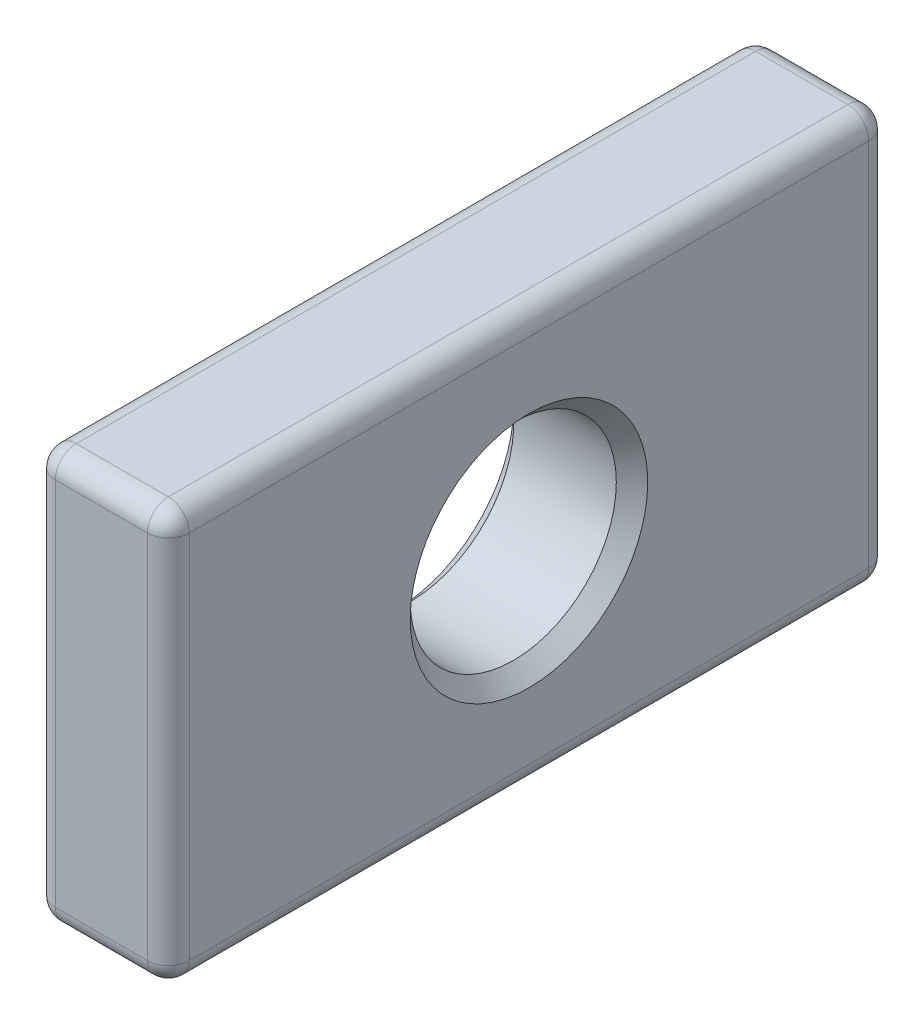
ISO-10303-21;
HEADER;
FILE_DESCRIPTION(('STEP AP214'),'2;1');
FILE_NAME('part.step','',(''),(''),'','','');
FILE_SCHEMA(('AUTOMOTIVE_DESIGN { 1 0 10303 214 1 1 1 1 }'));
ENDSEC;
DATA;
#1=APPLICATION_CONTEXT('core data for automotive mechanical design processes');
#2=APPLICATION_PROTOCOL_DEFINITION('international standard','automotive_design',2000,#1);
#3=PRODUCT_CONTEXT('',#1,'mechanical');
#4=PRODUCT('Part','Part','',(#3));
#5=PRODUCT_RELATED_PRODUCT_CATEGORY('part','',(#4));
#6=PRODUCT_DEFINITION_FORMATION('','',#4);
#7=PRODUCT_DEFINITION_CONTEXT('part definition',#1,'design');
#8=PRODUCT_DEFINITION('design','',#6,#7);
#9=PRODUCT_DEFINITION_SHAPE('','',#8);
#10=(LENGTH_UNIT() NAMED_UNIT(*) SI_UNIT(.MILLI.,.METRE.));
#11=(NAMED_UNIT(*) PLANE_ANGLE_UNIT() SI_UNIT($,.RADIAN.));
#12=(NAMED_UNIT(*) SI_UNIT($,.STERADIAN.) SOLID_ANGLE_UNIT());
#13=UNCERTAINTY_MEASURE_WITH_UNIT(LENGTH_MEASURE(1.E-05),#10,'distance_accuracy_value','');
#14=(GEOMETRIC_REPRESENTATION_CONTEXT(3) GLOBAL_UNCERTAINTY_ASSIGNED_CONTEXT((#13)) GLOBAL_UNIT_ASSIGNED_CONTEXT((#10,
#11,#12)) REPRESENTATION_CONTEXT('',''));
#15=CARTESIAN_POINT('',(0.,0.,0.));
#16=DIRECTION('',(0.,0.,1.));
#17=DIRECTION('',(1.,0.,0.));
#18=AXIS2_PLACEMENT_3D('',#15,#16,#17);
#19=CARTESIAN_POINT('',(3.25,0.,0.));
#20=DIRECTION('',(1.,0.,0.));
#21=DIRECTION('',(0.,0.,-1.));
#22=AXIS2_PLACEMENT_3D('',#19,#20,#21);
#23=PLANE('',#22);
#24=CARTESIAN_POINT('',(3.25,0.,0.));
#25=DIRECTION('',(1.,0.,0.));
#26=DIRECTION('',(0.,0.,-1.));
#27=AXIS2_PLACEMENT_3D('',#24,#25,#26);
#28=CIRCLE('',#27,5.76200000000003);
#29=CARTESIAN_POINT('',(3.25,0.,-5.76200000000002));
#30=VERTEX_POINT('',#29);
#31=EDGE_CURVE('E11',#30,#30,#28,.F.);
#32=ORIENTED_EDGE('',*,*,#31,.T.);
#33=EDGE_LOOP('',(#32));
#34=FACE_BOUND('',#33,.T.);
#35=DIRECTION('',(0.,0.,-1.));
#36=VECTOR('',#35,1.);
#37=CARTESIAN_POINT('',(3.25,-8.984,-17.5));
#38=LINE('',#37,#36);
#39=CARTESIAN_POINT('',(3.25,-8.984,16.484));
#40=VERTEX_POINT('',#39);
#41=CARTESIAN_POINT('',(3.25,-8.984,-16.484));
#42=VERTEX_POINT('',#41);
#43=EDGE_CURVE('E130',#40,#42,#38,.T.);
#44=ORIENTED_EDGE('',*,*,#43,.T.);
#45=DIRECTION('',(0.,1.,0.));
#46=VECTOR('',#45,1.);
#47=CARTESIAN_POINT('',(3.25,10.,-16.484));
#48=LINE('',#47,#46);
#49=CARTESIAN_POINT('',(3.25,8.984,-16.484));
#50=VERTEX_POINT('',#49);
#51=EDGE_CURVE('E126',#42,#50,#48,.T.);
#52=ORIENTED_EDGE('',*,*,#51,.T.);
#53=DIRECTION('',(0.,0.,1.));
#54=VECTOR('',#53,1.);
#55=CARTESIAN_POINT('',(3.25,8.984,17.5));
#56=LINE('',#55,#54);
#57=CARTESIAN_POINT('',(3.25,8.984,16.484));
#58=VERTEX_POINT('',#57);
#59=EDGE_CURVE('E119',#50,#58,#56,.T.);
#60=ORIENTED_EDGE('',*,*,#59,.T.);
#61=DIRECTION('',(0.,-1.,0.));
#62=VECTOR('',#61,1.);
#63=CARTESIAN_POINT('',(3.25,-10.,16.484));
#64=LINE('',#63,#62);
#65=EDGE_CURVE('E123',#58,#40,#64,.T.);
#66=ORIENTED_EDGE('',*,*,#65,.T.);
#67=EDGE_LOOP('',(#44,#52,#60,#66));
#68=FACE_BOUND('',#67,.T.);
#69=ADVANCED_FACE('F32',(#34,#68),#23,.T.);
#70=CARTESIAN_POINT('',(-3.25,0.,0.));
#71=DIRECTION('',(1.,0.,0.));
#72=DIRECTION('',(0.,0.,-1.));
#73=AXIS2_PLACEMENT_3D('',#70,#71,#72);
#74=PLANE('',#73);
#75=CARTESIAN_POINT('',(-3.25,0.,0.));
#76=DIRECTION('',(1.,0.,0.));
#77=DIRECTION('',(0.,0.,-1.));
#78=AXIS2_PLACEMENT_3D('',#75,#76,#77);
#79=CIRCLE('',#78,5.76199999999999);
#80=CARTESIAN_POINT('',(-3.25,0.,-5.76199999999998));
#81=VERTEX_POINT('',#80);
#82=EDGE_CURVE('E204',#81,#81,#79,.T.);
#83=ORIENTED_EDGE('',*,*,#82,.T.);
#84=EDGE_LOOP('',(#83));
#85=FACE_BOUND('',#84,.T.);
#86=DIRECTION('',(0.,0.,1.));
#87=VECTOR('',#86,1.);
#88=CARTESIAN_POINT('',(-3.25,8.984,0.));
#89=LINE('',#88,#87);
#90=CARTESIAN_POINT('',(-3.25,8.984,16.484));
#91=VERTEX_POINT('',#90);
#92=CARTESIAN_POINT('',(-3.25,8.984,-16.484));
#93=VERTEX_POINT('',#92);
#94=EDGE_CURVE('E175',#91,#93,#89,.F.);
#95=ORIENTED_EDGE('',*,*,#94,.T.);
#96=DIRECTION('',(0.,1.,0.));
#97=VECTOR('',#96,1.);
#98=CARTESIAN_POINT('',(-3.25,0.,-16.484));
#99=LINE('',#98,#97);
#100=CARTESIAN_POINT('',(-3.25,-8.984,-16.484));
#101=VERTEX_POINT('',#100);
#102=EDGE_CURVE('E180',#93,#101,#99,.F.);
#103=ORIENTED_EDGE('',*,*,#102,.T.);
#104=DIRECTION('',(0.,0.,-1.));
#105=VECTOR('',#104,1.);
#106=CARTESIAN_POINT('',(-3.25,-8.984,0.));
#107=LINE('',#106,#105);
#108=CARTESIAN_POINT('',(-3.25,-8.984,16.484));
#109=VERTEX_POINT('',#108);
#110=EDGE_CURVE('E177',#101,#109,#107,.F.);
#111=ORIENTED_EDGE('',*,*,#110,.T.);
#112=DIRECTION('',(0.,-1.,0.));
#113=VECTOR('',#112,1.);
#114=CARTESIAN_POINT('',(-3.25,0.,16.484));
#115=LINE('',#114,#113);
#116=EDGE_CURVE('E173',#109,#91,#115,.F.);
#117=ORIENTED_EDGE('',*,*,#116,.T.);
#118=EDGE_LOOP('',(#95,#103,#111,#117));
#119=FACE_BOUND('',#118,.T.);
#120=ADVANCED_FACE('F270',(#85,#119),#74,.F.);
#121=CARTESIAN_POINT('',(3.25,10.,-17.5));
#122=DIRECTION('',(0.,0.,1.));
#123=DIRECTION('',(0.,-1.,0.));
#124=AXIS2_PLACEMENT_3D('',#121,#122,#123);
#125=PLANE('',#124);
#126=DIRECTION('',(0.,1.,0.));
#127=VECTOR('',#126,1.);
#128=CARTESIAN_POINT('',(2.234,-10.,-17.5));
#129=LINE('',#128,#127);
#130=CARTESIAN_POINT('',(2.234,8.984,-17.5));
#131=VERTEX_POINT('',#130);
#132=CARTESIAN_POINT('',(2.234,-8.98399999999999,-17.5));
#133=VERTEX_POINT('',#132);
#134=EDGE_CURVE('E193',#131,#133,#129,.F.);
#135=ORIENTED_EDGE('',*,*,#134,.T.);
#136=DIRECTION('',(-1.,0.,0.));
#137=VECTOR('',#136,1.);
#138=CARTESIAN_POINT('',(3.25,-8.98399999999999,-17.5));
#139=LINE('',#138,#137);
#140=CARTESIAN_POINT('',(-2.234,-8.98399999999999,-17.5));
#141=VERTEX_POINT('',#140);
#142=EDGE_CURVE('E195',#133,#141,#139,.T.);
#143=ORIENTED_EDGE('',*,*,#142,.T.);
#144=DIRECTION('',(0.,1.,0.));
#145=VECTOR('',#144,1.);
#146=CARTESIAN_POINT('',(-2.234,10.,-17.5));
#147=LINE('',#146,#145);
#148=CARTESIAN_POINT('',(-2.234,8.984,-17.5));
#149=VERTEX_POINT('',#148);
#150=EDGE_CURVE('E189',#141,#149,#147,.T.);
#151=ORIENTED_EDGE('',*,*,#150,.T.);
#152=DIRECTION('',(-1.,0.,0.));
#153=VECTOR('',#152,1.);
#154=CARTESIAN_POINT('',(3.25,8.984,-17.5));
#155=LINE('',#154,#153);
#156=EDGE_CURVE('E191',#149,#131,#155,.F.);
#157=ORIENTED_EDGE('',*,*,#156,.T.);
#158=EDGE_LOOP('',(#135,#143,#151,#157));
#159=FACE_BOUND('',#158,.T.);
#160=ADVANCED_FACE('F273',(#159),#125,.F.);
#161=CARTESIAN_POINT('',(3.25,10.,17.5));
#162=DIRECTION('',(0.,-1.,0.));
#163=DIRECTION('',(0.,0.,-1.));
#164=AXIS2_PLACEMENT_3D('',#161,#162,#163);
#165=PLANE('',#164);
#166=DIRECTION('',(0.,0.,1.));
#167=VECTOR('',#166,1.);
#168=CARTESIAN_POINT('',(2.234,10.,-17.5));
#169=LINE('',#168,#167);
#170=CARTESIAN_POINT('',(2.234,10.,16.484));
#171=VERTEX_POINT('',#170);
#172=CARTESIAN_POINT('',(2.234,10.,-16.484));
#173=VERTEX_POINT('',#172);
#174=EDGE_CURVE('E138',#171,#173,#169,.F.);
#175=ORIENTED_EDGE('',*,*,#174,.T.);
#176=DIRECTION('',(-1.,0.,0.));
#177=VECTOR('',#176,1.);
#178=CARTESIAN_POINT('',(3.25,10.,-16.484));
#179=LINE('',#178,#177);
#180=CARTESIAN_POINT('',(-2.234,10.,-16.484));
#181=VERTEX_POINT('',#180);
#182=EDGE_CURVE('E187',#173,#181,#179,.T.);
#183=ORIENTED_EDGE('',*,*,#182,.T.);
#184=DIRECTION('',(0.,0.,1.));
#185=VECTOR('',#184,1.);
#186=CARTESIAN_POINT('',(-2.234,10.,17.5));
#187=LINE('',#186,#185);
#188=CARTESIAN_POINT('',(-2.234,10.,16.484));
#189=VERTEX_POINT('',#188);
#190=EDGE_CURVE('E184',#181,#189,#187,.T.);
#191=ORIENTED_EDGE('',*,*,#190,.T.);
#192=DIRECTION('',(-1.,0.,0.));
#193=VECTOR('',#192,1.);
#194=CARTESIAN_POINT('',(3.25,10.,16.484));
#195=LINE('',#194,#193);
#196=EDGE_CURVE('E182',#189,#171,#195,.F.);
#197=ORIENTED_EDGE('',*,*,#196,.T.);
#198=EDGE_LOOP('',(#175,#183,#191,#197));
#199=FACE_BOUND('',#198,.T.);
#200=ADVANCED_FACE('F317',(#199),#165,.F.);
#201=CARTESIAN_POINT('',(3.25,10.,17.5));
#202=DIRECTION('',(0.,0.,-1.));
#203=DIRECTION('',(-1.,0.,0.));
#204=AXIS2_PLACEMENT_3D('',#201,#202,#203);
#205=PLANE('',#204);
#206=DIRECTION('',(0.,-1.,0.));
#207=VECTOR('',#206,1.);
#208=CARTESIAN_POINT('',(2.234,10.,17.5));
#209=LINE('',#208,#207);
#210=CARTESIAN_POINT('',(2.234,-8.984,17.5));
#211=VERTEX_POINT('',#210);
#212=CARTESIAN_POINT('',(2.234,8.984,17.5));
#213=VERTEX_POINT('',#212);
#214=EDGE_CURVE('E47',#211,#213,#209,.F.);
#215=ORIENTED_EDGE('',*,*,#214,.T.);
#216=DIRECTION('',(-1.,0.,0.));
#217=VECTOR('',#216,1.);
#218=CARTESIAN_POINT('',(3.25,8.984,17.5));
#219=LINE('',#218,#217);
#220=CARTESIAN_POINT('',(-2.234,8.984,17.5));
#221=VERTEX_POINT('',#220);
#222=EDGE_CURVE('E202',#213,#221,#219,.T.);
#223=ORIENTED_EDGE('',*,*,#222,.T.);
#224=DIRECTION('',(0.,-1.,0.));
#225=VECTOR('',#224,1.);
#226=CARTESIAN_POINT('',(-2.234,10.,17.5));
#227=LINE('',#226,#225);
#228=CARTESIAN_POINT('',(-2.234,-8.984,17.5));
#229=VERTEX_POINT('',#228);
#230=EDGE_CURVE('E198',#221,#229,#227,.T.);
#231=ORIENTED_EDGE('',*,*,#230,.T.);
#232=DIRECTION('',(-1.,0.,0.));
#233=VECTOR('',#232,1.);
#234=CARTESIAN_POINT('',(3.25,-8.984,17.5));
#235=LINE('',#234,#233);
#236=EDGE_CURVE('E52',#229,#211,#235,.F.);
#237=ORIENTED_EDGE('',*,*,#236,.T.);
#238=EDGE_LOOP('',(#215,#223,#231,#237));
#239=FACE_BOUND('',#238,.T.);
#240=ADVANCED_FACE('F314',(#239),#205,.F.);
#241=CARTESIAN_POINT('',(3.25,-10.,17.5));
#242=DIRECTION('',(0.,1.,0.));
#243=DIRECTION('',(0.,0.,1.));
#244=AXIS2_PLACEMENT_3D('',#241,#242,#243);
#245=PLANE('',#244);
#246=DIRECTION('',(0.,0.,-1.));
#247=VECTOR('',#246,1.);
#248=CARTESIAN_POINT('',(-2.234,-10.,17.5));
#249=LINE('',#248,#247);
#250=CARTESIAN_POINT('',(-2.234,-10.,16.484));
#251=VERTEX_POINT('',#250);
#252=CARTESIAN_POINT('',(-2.234,-10.,-16.484));
#253=VERTEX_POINT('',#252);
#254=EDGE_CURVE('E166',#251,#253,#249,.T.);
#255=ORIENTED_EDGE('',*,*,#254,.T.);
#256=DIRECTION('',(-1.,0.,0.));
#257=VECTOR('',#256,1.);
#258=CARTESIAN_POINT('',(3.25,-10.,-16.484));
#259=LINE('',#258,#257);
#260=CARTESIAN_POINT('',(2.234,-10.,-16.484));
#261=VERTEX_POINT('',#260);
#262=EDGE_CURVE('E171',#253,#261,#259,.F.);
#263=ORIENTED_EDGE('',*,*,#262,.T.);
#264=DIRECTION('',(0.,0.,-1.));
#265=VECTOR('',#264,1.);
#266=CARTESIAN_POINT('',(2.234,-10.,17.5));
#267=LINE('',#266,#265);
#268=CARTESIAN_POINT('',(2.234,-10.,16.484));
#269=VERTEX_POINT('',#268);
#270=EDGE_CURVE('E168',#261,#269,#267,.F.);
#271=ORIENTED_EDGE('',*,*,#270,.T.);
#272=DIRECTION('',(-1.,0.,0.));
#273=VECTOR('',#272,1.);
#274=CARTESIAN_POINT('',(3.25,-10.,16.484));
#275=LINE('',#274,#273);
#276=EDGE_CURVE('E164',#269,#251,#275,.T.);
#277=ORIENTED_EDGE('',*,*,#276,.T.);
#278=EDGE_LOOP('',(#255,#263,#271,#277));
#279=FACE_BOUND('',#278,.T.);
#280=ADVANCED_FACE('F316',(#279),#245,.F.);
#281=CARTESIAN_POINT('',(3.25,0.,0.));
#282=DIRECTION('',(-1.,0.,0.));
#283=DIRECTION('',(0.,0.,1.));
#284=AXIS2_PLACEMENT_3D('',#281,#282,#283);
#285=CYLINDRICAL_SURFACE('',#284,5.);
#286=CARTESIAN_POINT('',(-2.48800000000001,0.,0.));
#287=DIRECTION('',(1.,0.,0.));
#288=DIRECTION('',(0.,0.,-1.));
#289=AXIS2_PLACEMENT_3D('',#286,#287,#288);
#290=CIRCLE('',#289,5.);
#291=CARTESIAN_POINT('',(-2.48800000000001,0.,5.00000000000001));
#292=VERTEX_POINT('',#291);
#293=EDGE_CURVE('E40',#292,#292,#290,.F.);
#294=CARTESIAN_POINT('',(2.48799999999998,0.,0.));
#295=DIRECTION('',(1.,0.,0.));
#296=DIRECTION('',(0.,0.,-1.));
#297=AXIS2_PLACEMENT_3D('',#294,#295,#296);
#298=CIRCLE('',#297,5.);
#299=CARTESIAN_POINT('',(2.48799999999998,0.,5.00000000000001));
#300=VERTEX_POINT('',#299);
#301=EDGE_CURVE('E256',#300,#300,#298,.T.);
#302=CARTESIAN_POINT('',(-2.48800000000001,0.,5.00000000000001));
#303=CARTESIAN_POINT('',(-2.43616666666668,0.,5.00000000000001));
#304=CARTESIAN_POINT('',(-2.38433333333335,0.,5.00000000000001));
#305=CARTESIAN_POINT('',(-2.28066666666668,0.,5.00000000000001));
#306=CARTESIAN_POINT('',(-2.22883333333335,0.,5.00000000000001));
#307=CARTESIAN_POINT('',(-2.12516666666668,0.,5.00000000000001));
#308=CARTESIAN_POINT('',(-2.07333333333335,0.,5.00000000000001));
#309=CARTESIAN_POINT('',(-1.96966666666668,0.,5.00000000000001));
#310=CARTESIAN_POINT('',(-1.91783333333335,0.,5.00000000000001));
#311=CARTESIAN_POINT('',(-1.81416666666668,0.,5.00000000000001));
#312=CARTESIAN_POINT('',(-1.76233333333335,0.,5.00000000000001));
#313=CARTESIAN_POINT('',(-1.65866666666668,0.,5.00000000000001));
#314=CARTESIAN_POINT('',(-1.60683333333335,0.,5.00000000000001));
#315=CARTESIAN_POINT('',(-1.50316666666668,0.,5.00000000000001));
#316=CARTESIAN_POINT('',(-1.45133333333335,0.,5.00000000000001));
#317=CARTESIAN_POINT('',(-1.34766666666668,0.,5.00000000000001));
#318=CARTESIAN_POINT('',(-1.29583333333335,0.,5.00000000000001));
#319=CARTESIAN_POINT('',(-1.19216666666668,0.,5.00000000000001));
#320=CARTESIAN_POINT('',(-1.14033333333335,0.,5.00000000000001));
#321=CARTESIAN_POINT('',(-1.03666666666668,0.,5.00000000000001));
#322=CARTESIAN_POINT('',(-0.984833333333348,0.,5.00000000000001));
#323=CARTESIAN_POINT('',(-0.881166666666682,0.,5.00000000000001));
#324=CARTESIAN_POINT('',(-0.829333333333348,0.,5.00000000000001));
#325=CARTESIAN_POINT('',(-0.725666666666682,0.,5.00000000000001));
#326=CARTESIAN_POINT('',(-0.673833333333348,0.,5.00000000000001));
#327=CARTESIAN_POINT('',(-0.570166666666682,0.,5.00000000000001));
#328=CARTESIAN_POINT('',(-0.518333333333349,0.,5.00000000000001));
#329=CARTESIAN_POINT('',(-0.414666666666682,0.,5.00000000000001));
#330=CARTESIAN_POINT('',(-0.362833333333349,0.,5.00000000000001));
#331=CARTESIAN_POINT('',(-0.259166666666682,0.,5.00000000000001));
#332=CARTESIAN_POINT('',(-0.207333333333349,0.,5.00000000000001));
#333=CARTESIAN_POINT('',(-0.103666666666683,0.,5.00000000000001));
#334=CARTESIAN_POINT('',(-0.0518333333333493,0.,5.00000000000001));
#335=CARTESIAN_POINT('',(0.0518333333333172,0.,5.00000000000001));
#336=CARTESIAN_POINT('',(0.10366666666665,0.,5.00000000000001));
#337=CARTESIAN_POINT('',(0.207333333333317,0.,5.00000000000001));
#338=CARTESIAN_POINT('',(0.25916666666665,0.,5.00000000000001));
#339=CARTESIAN_POINT('',(0.362833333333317,0.,5.00000000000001));
#340=CARTESIAN_POINT('',(0.41466666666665,0.,5.00000000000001));
#341=CARTESIAN_POINT('',(0.518333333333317,0.,5.00000000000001));
#342=CARTESIAN_POINT('',(0.57016666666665,0.,5.00000000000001));
#343=CARTESIAN_POINT('',(0.673833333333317,0.,5.00000000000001));
#344=CARTESIAN_POINT('',(0.72566666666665,0.,5.00000000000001));
#345=CARTESIAN_POINT('',(0.829333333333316,0.,5.00000000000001));
#346=CARTESIAN_POINT('',(0.88116666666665,0.,5.00000000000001));
#347=CARTESIAN_POINT('',(0.984833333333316,0.,5.00000000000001));
#348=CARTESIAN_POINT('',(1.03666666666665,0.,5.00000000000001));
#349=CARTESIAN_POINT('',(1.14033333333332,0.,5.00000000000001));
#350=CARTESIAN_POINT('',(1.19216666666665,0.,5.00000000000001));
#351=CARTESIAN_POINT('',(1.29583333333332,0.,5.00000000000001));
#352=CARTESIAN_POINT('',(1.34766666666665,0.,5.00000000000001));
#353=CARTESIAN_POINT('',(1.45133333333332,0.,5.00000000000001));
#354=CARTESIAN_POINT('',(1.50316666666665,0.,5.00000000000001));
#355=CARTESIAN_POINT('',(1.60683333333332,0.,5.00000000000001));
#356=CARTESIAN_POINT('',(1.65866666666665,0.,5.00000000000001));
#357=CARTESIAN_POINT('',(1.76233333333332,0.,5.00000000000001));
#358=CARTESIAN_POINT('',(1.81416666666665,0.,5.00000000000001));
#359=CARTESIAN_POINT('',(1.91783333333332,0.,5.00000000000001));
#360=CARTESIAN_POINT('',(1.96966666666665,0.,5.00000000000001));
#361=CARTESIAN_POINT('',(2.07333333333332,0.,5.00000000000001));
#362=CARTESIAN_POINT('',(2.12516666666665,0.,5.00000000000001));
#363=CARTESIAN_POINT('',(2.22883333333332,0.,5.00000000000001));
#364=CARTESIAN_POINT('',(2.28066666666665,0.,5.00000000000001));
#365=CARTESIAN_POINT('',(2.38433333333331,0.,5.00000000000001));
#366=CARTESIAN_POINT('',(2.43616666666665,0.,5.00000000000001));
#367=CARTESIAN_POINT('',(2.48799999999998,0.,5.00000000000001));
#368=B_SPLINE_CURVE_WITH_KNOTS('',3,(#302,#303,#304,#305,#306,#307,#308,#309,#310,#311,#312,
#313,#314,#315,#316,#317,#318,#319,#320,#321,#322,#323,#324,#325,#326,#327,#328,#329,#330,#331,
#332,#333,#334,#335,#336,#337,#338,#339,#340,#341,#342,#343,#344,#345,#346,#347,#348,#349,#350,
#351,#352,#353,#354,#355,#356,#357,#358,#359,#360,#361,#362,#363,#364,#365,#366,#367),
.UNSPECIFIED.,.F.,.F.,(4,2,2,2,2,2,2,2,2,2,2,2,2,2,2,2,2,2,2,2,2,2,2,2,2,2,2,2,2,2,2,2,4),(0.,
0.1555,0.311,0.4665,0.621999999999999,0.7775,0.932999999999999,1.0885,1.244,1.3995,1.555,1.7105,
1.866,2.0215,2.177,2.3325,2.488,2.6435,2.799,2.9545,3.11,3.2655,3.421,3.5765,3.732,3.8875,4.043,
4.1985,4.354,4.5095,4.665,4.82049999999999,4.976),.UNSPECIFIED.);
#369=EDGE_CURVE('BSEAM261',#292,#300,#368,.T.);
#370=ORIENTED_EDGE('',*,*,#293,.T.);
#371=ORIENTED_EDGE('',*,*,#301,.T.);
#372=ORIENTED_EDGE('',*,*,#369,.T.);
#373=ORIENTED_EDGE('',*,*,#369,.F.);
#374=EDGE_LOOP('',(#370,#372,#371,#373));
#375=FACE_BOUND('',#374,.T.);
#376=ADVANCED_FACE('F261',(#375),#285,.F.);
#377=CARTESIAN_POINT('',(-2.234,8.984,17.5));
#378=DIRECTION('',(0.,0.,1.));
#379=DIRECTION('',(1.,0.,0.));
#380=AXIS2_PLACEMENT_3D('',#377,#378,#379);
#381=CYLINDRICAL_SURFACE('',#380,1.016);
#382=CARTESIAN_POINT('',(-2.234,8.984,16.484));
#383=DIRECTION('',(0.,0.,1.));
#384=DIRECTION('',(1.,0.,0.));
#385=AXIS2_PLACEMENT_3D('',#382,#383,#384);
#386=CIRCLE('',#385,1.016);
#387=EDGE_CURVE('E156',#189,#91,#386,.T.);
#388=ORIENTED_EDGE('',*,*,#387,.F.);
#389=ORIENTED_EDGE('',*,*,#190,.F.);
#390=CARTESIAN_POINT('',(-2.234,8.984,-16.484));
#391=DIRECTION('',(0.,0.,-1.));
#392=DIRECTION('',(0.,1.,0.));
#393=AXIS2_PLACEMENT_3D('',#390,#391,#392);
#394=CIRCLE('',#393,1.016);
#395=EDGE_CURVE('E159',#93,#181,#394,.T.);
#396=ORIENTED_EDGE('',*,*,#395,.F.);
#397=ORIENTED_EDGE('',*,*,#94,.F.);
#398=EDGE_LOOP('',(#388,#389,#396,#397));
#399=FACE_BOUND('',#398,.T.);
#400=ADVANCED_FACE('F284',(#399),#381,.T.);
#401=CARTESIAN_POINT('',(-2.234,8.984,16.484));
#402=DIRECTION('',(0.,0.,1.));
#403=DIRECTION('',(1.,0.,0.));
#404=AXIS2_PLACEMENT_3D('',#401,#402,#403);
#405=SPHERICAL_SURFACE('',#404,1.016);
#406=CARTESIAN_POINT('',(-2.234,8.984,16.484));
#407=DIRECTION('',(-1.,0.,0.));
#408=DIRECTION('',(0.,0.,1.));
#409=AXIS2_PLACEMENT_3D('',#406,#407,#408);
#410=CIRCLE('',#409,1.016);
#411=EDGE_CURVE('E246',#189,#221,#410,.F.);
#412=ORIENTED_EDGE('',*,*,#411,.F.);
#413=ORIENTED_EDGE('',*,*,#387,.T.);
#414=CARTESIAN_POINT('',(-2.234,8.984,16.484));
#415=DIRECTION('',(0.,1.,0.));
#416=DIRECTION('',(0.,0.,1.));
#417=AXIS2_PLACEMENT_3D('',#414,#415,#416);
#418=CIRCLE('',#417,1.016);
#419=EDGE_CURVE('E249',#221,#91,#418,.F.);
#420=ORIENTED_EDGE('',*,*,#419,.F.);
#421=EDGE_LOOP('',(#412,#413,#420));
#422=FACE_BOUND('',#421,.T.);
#423=ADVANCED_FACE('F310',(#422),#405,.T.);
#424=CARTESIAN_POINT('',(-2.234,8.984,-16.484));
#425=DIRECTION('',(0.,0.,1.));
#426=DIRECTION('',(1.,0.,0.));
#427=AXIS2_PLACEMENT_3D('',#424,#425,#426);
#428=SPHERICAL_SURFACE('',#427,1.016);
#429=CARTESIAN_POINT('',(-2.234,8.984,-16.484));
#430=DIRECTION('',(0.,1.,0.));
#431=DIRECTION('',(0.,0.,1.));
#432=AXIS2_PLACEMENT_3D('',#429,#430,#431);
#433=CIRCLE('',#432,1.016);
#434=EDGE_CURVE('E240',#93,#149,#433,.F.);
#435=ORIENTED_EDGE('',*,*,#434,.F.);
#436=ORIENTED_EDGE('',*,*,#395,.T.);
#437=CARTESIAN_POINT('',(-2.234,8.984,-16.484));
#438=DIRECTION('',(-1.,0.,0.));
#439=DIRECTION('',(0.,0.,1.));
#440=AXIS2_PLACEMENT_3D('',#437,#438,#439);
#441=CIRCLE('',#440,1.016);
#442=EDGE_CURVE('E243',#149,#181,#441,.F.);
#443=ORIENTED_EDGE('',*,*,#442,.F.);
#444=EDGE_LOOP('',(#435,#436,#443));
#445=FACE_BOUND('',#444,.T.);
#446=ADVANCED_FACE('F287',(#445),#428,.T.);
#447=CARTESIAN_POINT('',(-2.234,10.,16.484));
#448=DIRECTION('',(0.,-1.,0.));
#449=DIRECTION('',(0.,0.,-1.));
#450=AXIS2_PLACEMENT_3D('',#447,#448,#449);
#451=CYLINDRICAL_SURFACE('',#450,1.016);
#452=ORIENTED_EDGE('',*,*,#419,.T.);
#453=ORIENTED_EDGE('',*,*,#116,.F.);
#454=CARTESIAN_POINT('',(-2.234,-8.984,16.484));
#455=DIRECTION('',(0.,-1.,0.));
#456=DIRECTION('',(0.,0.,-1.));
#457=AXIS2_PLACEMENT_3D('',#454,#455,#456);
#458=CIRCLE('',#457,1.016);
#459=EDGE_CURVE('E235',#229,#109,#458,.T.);
#460=ORIENTED_EDGE('',*,*,#459,.F.);
#461=ORIENTED_EDGE('',*,*,#230,.F.);
#462=EDGE_LOOP('',(#452,#453,#460,#461));
#463=FACE_BOUND('',#462,.T.);
#464=ADVANCED_FACE('F306',(#463),#451,.T.);
#465=CARTESIAN_POINT('',(3.25,8.984,16.484));
#466=DIRECTION('',(-1.,0.,0.));
#467=DIRECTION('',(0.,0.,1.));
#468=AXIS2_PLACEMENT_3D('',#465,#466,#467);
#469=CYLINDRICAL_SURFACE('',#468,1.016);
#470=ORIENTED_EDGE('',*,*,#411,.T.);
#471=ORIENTED_EDGE('',*,*,#222,.F.);
#472=CARTESIAN_POINT('',(2.234,8.984,16.484));
#473=DIRECTION('',(1.,0.,0.));
#474=DIRECTION('',(0.,0.,-1.));
#475=AXIS2_PLACEMENT_3D('',#472,#473,#474);
#476=CIRCLE('',#475,1.016);
#477=EDGE_CURVE('E142',#171,#213,#476,.T.);
#478=ORIENTED_EDGE('',*,*,#477,.F.);
#479=ORIENTED_EDGE('',*,*,#196,.F.);
#480=EDGE_LOOP('',(#470,#471,#478,#479));
#481=FACE_BOUND('',#480,.T.);
#482=ADVANCED_FACE('F313',(#481),#469,.T.);
#483=CARTESIAN_POINT('',(2.234,8.984,0.));
#484=DIRECTION('',(0.,0.,-1.));
#485=DIRECTION('',(-1.,0.,0.));
#486=AXIS2_PLACEMENT_3D('',#483,#484,#485);
#487=CYLINDRICAL_SURFACE('',#486,1.016);
#488=CARTESIAN_POINT('',(2.234,8.984,-16.484));
#489=DIRECTION('',(0.,0.,-1.));
#490=DIRECTION('',(-1.,0.,0.));
#491=AXIS2_PLACEMENT_3D('',#488,#489,#490);
#492=CIRCLE('',#491,1.016);
#493=EDGE_CURVE('E143',#173,#50,#492,.T.);
#494=ORIENTED_EDGE('',*,*,#493,.F.);
#495=ORIENTED_EDGE('',*,*,#174,.F.);
#496=CARTESIAN_POINT('',(2.234,8.984,16.484));
#497=DIRECTION('',(0.,0.,1.));
#498=DIRECTION('',(1.,0.,0.));
#499=AXIS2_PLACEMENT_3D('',#496,#497,#498);
#500=CIRCLE('',#499,1.016);
#501=EDGE_CURVE('E134',#58,#171,#500,.T.);
#502=ORIENTED_EDGE('',*,*,#501,.F.);
#503=ORIENTED_EDGE('',*,*,#59,.F.);
#504=EDGE_LOOP('',(#494,#495,#502,#503));
#505=FACE_BOUND('',#504,.T.);
#506=ADVANCED_FACE('F136',(#505),#487,.T.);
#507=CARTESIAN_POINT('',(3.25,8.984,-16.484));
#508=DIRECTION('',(-1.,0.,0.));
#509=DIRECTION('',(0.,0.,1.));
#510=AXIS2_PLACEMENT_3D('',#507,#508,#509);
#511=CYLINDRICAL_SURFACE('',#510,1.016);
#512=ORIENTED_EDGE('',*,*,#442,.T.);
#513=ORIENTED_EDGE('',*,*,#182,.F.);
#514=CARTESIAN_POINT('',(2.234,8.984,-16.484));
#515=DIRECTION('',(1.,0.,0.));
#516=DIRECTION('',(0.,0.,-1.));
#517=AXIS2_PLACEMENT_3D('',#514,#515,#516);
#518=CIRCLE('',#517,1.016);
#519=EDGE_CURVE('E231',#131,#173,#518,.T.);
#520=ORIENTED_EDGE('',*,*,#519,.F.);
#521=ORIENTED_EDGE('',*,*,#156,.F.);
#522=EDGE_LOOP('',(#512,#513,#520,#521));
#523=FACE_BOUND('',#522,.T.);
#524=ADVANCED_FACE('F351',(#523),#511,.T.);
#525=CARTESIAN_POINT('',(-2.234,10.,-16.484));
#526=DIRECTION('',(0.,1.,0.));
#527=DIRECTION('',(0.,0.,1.));
#528=AXIS2_PLACEMENT_3D('',#525,#526,#527);
#529=CYLINDRICAL_SURFACE('',#528,1.016);
#530=ORIENTED_EDGE('',*,*,#434,.T.);
#531=ORIENTED_EDGE('',*,*,#150,.F.);
#532=CARTESIAN_POINT('',(-2.234,-8.984,-16.484));
#533=DIRECTION('',(0.,-1.,0.));
#534=DIRECTION('',(0.,0.,-1.));
#535=AXIS2_PLACEMENT_3D('',#532,#533,#534);
#536=CIRCLE('',#535,1.016);
#537=EDGE_CURVE('E228',#101,#141,#536,.T.);
#538=ORIENTED_EDGE('',*,*,#537,.F.);
#539=ORIENTED_EDGE('',*,*,#102,.F.);
#540=EDGE_LOOP('',(#530,#531,#538,#539));
#541=FACE_BOUND('',#540,.T.);
#542=ADVANCED_FACE('F292',(#541),#529,.T.);
#543=CARTESIAN_POINT('',(-2.234,-8.984,17.5));
#544=DIRECTION('',(0.,0.,-1.));
#545=DIRECTION('',(-1.,0.,0.));
#546=AXIS2_PLACEMENT_3D('',#543,#544,#545);
#547=CYLINDRICAL_SURFACE('',#546,1.016);
#548=CARTESIAN_POINT('',(-2.234,-8.984,16.484));
#549=DIRECTION('',(0.,0.,1.));
#550=DIRECTION('',(1.,0.,0.));
#551=AXIS2_PLACEMENT_3D('',#548,#549,#550);
#552=CIRCLE('',#551,1.016);
#553=EDGE_CURVE('E237',#109,#251,#552,.T.);
#554=ORIENTED_EDGE('',*,*,#553,.F.);
#555=ORIENTED_EDGE('',*,*,#110,.F.);
#556=CARTESIAN_POINT('',(-2.234,-8.984,-16.484));
#557=DIRECTION('',(0.,0.,-1.));
#558=DIRECTION('',(-1.,0.,0.));
#559=AXIS2_PLACEMENT_3D('',#556,#557,#558);
#560=CIRCLE('',#559,1.016);
#561=EDGE_CURVE('E225',#253,#101,#560,.T.);
#562=ORIENTED_EDGE('',*,*,#561,.F.);
#563=ORIENTED_EDGE('',*,*,#254,.F.);
#564=EDGE_LOOP('',(#554,#555,#562,#563));
#565=FACE_BOUND('',#564,.T.);
#566=ADVANCED_FACE('F301',(#565),#547,.T.);
#567=CARTESIAN_POINT('',(-2.234,-8.984,16.484));
#568=DIRECTION('',(0.,0.,1.));
#569=DIRECTION('',(1.,0.,0.));
#570=AXIS2_PLACEMENT_3D('',#567,#568,#569);
#571=SPHERICAL_SURFACE('',#570,1.016);
#572=ORIENTED_EDGE('',*,*,#459,.T.);
#573=ORIENTED_EDGE('',*,*,#553,.T.);
#574=CARTESIAN_POINT('',(-2.234,-8.984,16.484));
#575=DIRECTION('',(-1.,0.,0.));
#576=DIRECTION('',(0.,0.,1.));
#577=AXIS2_PLACEMENT_3D('',#574,#575,#576);
#578=CIRCLE('',#577,1.016);
#579=EDGE_CURVE('E149',#229,#251,#578,.F.);
#580=ORIENTED_EDGE('',*,*,#579,.F.);
#581=EDGE_LOOP('',(#572,#573,#580));
#582=FACE_BOUND('',#581,.T.);
#583=ADVANCED_FACE('F359',(#582),#571,.T.);
#584=CARTESIAN_POINT('',(2.234,8.984,16.484));
#585=DIRECTION('',(0.,0.,1.));
#586=DIRECTION('',(1.,0.,0.));
#587=AXIS2_PLACEMENT_3D('',#584,#585,#586);
#588=SPHERICAL_SURFACE('',#587,1.016);
#589=ORIENTED_EDGE('',*,*,#501,.T.);
#590=ORIENTED_EDGE('',*,*,#477,.T.);
#591=CARTESIAN_POINT('',(2.234,8.984,16.484));
#592=DIRECTION('',(0.,1.,0.));
#593=DIRECTION('',(0.,0.,1.));
#594=AXIS2_PLACEMENT_3D('',#591,#592,#593);
#595=CIRCLE('',#594,1.016);
#596=EDGE_CURVE('E146',#58,#213,#595,.F.);
#597=ORIENTED_EDGE('',*,*,#596,.F.);
#598=EDGE_LOOP('',(#589,#590,#597));
#599=FACE_BOUND('',#598,.T.);
#600=ADVANCED_FACE('F147',(#599),#588,.T.);
#601=CARTESIAN_POINT('',(2.234,8.984,-16.484));
#602=DIRECTION('',(0.,0.,1.));
#603=DIRECTION('',(1.,0.,0.));
#604=AXIS2_PLACEMENT_3D('',#601,#602,#603);
#605=SPHERICAL_SURFACE('',#604,1.016);
#606=ORIENTED_EDGE('',*,*,#519,.T.);
#607=ORIENTED_EDGE('',*,*,#493,.T.);
#608=CARTESIAN_POINT('',(2.234,8.984,-16.484));
#609=DIRECTION('',(0.,1.,0.));
#610=DIRECTION('',(0.,0.,1.));
#611=AXIS2_PLACEMENT_3D('',#608,#609,#610);
#612=CIRCLE('',#611,1.016);
#613=EDGE_CURVE('E150',#131,#50,#612,.F.);
#614=ORIENTED_EDGE('',*,*,#613,.F.);
#615=EDGE_LOOP('',(#606,#607,#614));
#616=FACE_BOUND('',#615,.T.);
#617=ADVANCED_FACE('F364',(#616),#605,.T.);
#618=CARTESIAN_POINT('',(-2.234,-8.984,-16.484));
#619=DIRECTION('',(0.,0.,1.));
#620=DIRECTION('',(1.,0.,0.));
#621=AXIS2_PLACEMENT_3D('',#618,#619,#620);
#622=SPHERICAL_SURFACE('',#621,1.016);
#623=ORIENTED_EDGE('',*,*,#561,.T.);
#624=ORIENTED_EDGE('',*,*,#537,.T.);
#625=CARTESIAN_POINT('',(-2.234,-8.98399999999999,-16.484));
#626=DIRECTION('',(-1.,0.,0.));
#627=DIRECTION('',(0.,0.,1.));
#628=AXIS2_PLACEMENT_3D('',#625,#626,#627);
#629=CIRCLE('',#628,1.016);
#630=EDGE_CURVE('E219',#253,#141,#629,.F.);
#631=ORIENTED_EDGE('',*,*,#630,.F.);
#632=EDGE_LOOP('',(#623,#624,#631));
#633=FACE_BOUND('',#632,.T.);
#634=ADVANCED_FACE('F296',(#633),#622,.T.);
#635=CARTESIAN_POINT('',(3.25,-8.984,16.484));
#636=DIRECTION('',(-1.,0.,0.));
#637=DIRECTION('',(0.,0.,1.));
#638=AXIS2_PLACEMENT_3D('',#635,#636,#637);
#639=CYLINDRICAL_SURFACE('',#638,1.016);
#640=ORIENTED_EDGE('',*,*,#579,.T.);
#641=ORIENTED_EDGE('',*,*,#276,.F.);
#642=CARTESIAN_POINT('',(2.234,-8.984,16.484));
#643=DIRECTION('',(1.,0.,0.));
#644=DIRECTION('',(0.,0.,-1.));
#645=AXIS2_PLACEMENT_3D('',#642,#643,#644);
#646=CIRCLE('',#645,1.016);
#647=EDGE_CURVE('E216',#211,#269,#646,.T.);
#648=ORIENTED_EDGE('',*,*,#647,.F.);
#649=ORIENTED_EDGE('',*,*,#236,.F.);
#650=EDGE_LOOP('',(#640,#641,#648,#649));
#651=FACE_BOUND('',#650,.T.);
#652=ADVANCED_FACE('F370',(#651),#639,.T.);
#653=CARTESIAN_POINT('',(2.234,0.,16.484));
#654=DIRECTION('',(0.,1.,0.));
#655=DIRECTION('',(0.,0.,1.));
#656=AXIS2_PLACEMENT_3D('',#653,#654,#655);
#657=CYLINDRICAL_SURFACE('',#656,1.016);
#658=ORIENTED_EDGE('',*,*,#596,.T.);
#659=ORIENTED_EDGE('',*,*,#214,.F.);
#660=CARTESIAN_POINT('',(2.234,-8.984,16.484));
#661=DIRECTION('',(0.,-1.,0.));
#662=DIRECTION('',(0.,0.,-1.));
#663=AXIS2_PLACEMENT_3D('',#660,#661,#662);
#664=CIRCLE('',#663,1.016);
#665=EDGE_CURVE('E154',#40,#211,#664,.T.);
#666=ORIENTED_EDGE('',*,*,#665,.F.);
#667=ORIENTED_EDGE('',*,*,#65,.F.);
#668=EDGE_LOOP('',(#658,#659,#666,#667));
#669=FACE_BOUND('',#668,.T.);
#670=ADVANCED_FACE('F152',(#669),#657,.T.);
#671=CARTESIAN_POINT('',(2.234,0.,-16.484));
#672=DIRECTION('',(0.,-1.,0.));
#673=DIRECTION('',(0.,0.,-1.));
#674=AXIS2_PLACEMENT_3D('',#671,#672,#673);
#675=CYLINDRICAL_SURFACE('',#674,1.016);
#676=ORIENTED_EDGE('',*,*,#613,.T.);
#677=ORIENTED_EDGE('',*,*,#51,.F.);
#678=CARTESIAN_POINT('',(2.234,-8.98399999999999,-16.484));
#679=DIRECTION('',(0.,-1.,0.));
#680=DIRECTION('',(1.,0.,0.));
#681=AXIS2_PLACEMENT_3D('',#678,#679,#680);
#682=CIRCLE('',#681,1.016);
#683=EDGE_CURVE('E212',#133,#42,#682,.T.);
#684=ORIENTED_EDGE('',*,*,#683,.F.);
#685=ORIENTED_EDGE('',*,*,#134,.F.);
#686=EDGE_LOOP('',(#676,#677,#684,#685));
#687=FACE_BOUND('',#686,.T.);
#688=ADVANCED_FACE('F376',(#687),#675,.T.);
#689=CARTESIAN_POINT('',(3.25,-8.98399999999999,-16.484));
#690=DIRECTION('',(-1.,0.,0.));
#691=DIRECTION('',(0.,0.,1.));
#692=AXIS2_PLACEMENT_3D('',#689,#690,#691);
#693=CYLINDRICAL_SURFACE('',#692,1.016);
#694=ORIENTED_EDGE('',*,*,#630,.T.);
#695=ORIENTED_EDGE('',*,*,#142,.F.);
#696=CARTESIAN_POINT('',(2.234,-8.984,-16.484));
#697=DIRECTION('',(1.,0.,0.));
#698=DIRECTION('',(0.,0.,-1.));
#699=AXIS2_PLACEMENT_3D('',#696,#697,#698);
#700=CIRCLE('',#699,1.016);
#701=EDGE_CURVE('E209',#261,#133,#700,.T.);
#702=ORIENTED_EDGE('',*,*,#701,.F.);
#703=ORIENTED_EDGE('',*,*,#262,.F.);
#704=EDGE_LOOP('',(#694,#695,#702,#703));
#705=FACE_BOUND('',#704,.T.);
#706=ADVANCED_FACE('F379',(#705),#693,.T.);
#707=CARTESIAN_POINT('',(2.234,-8.984,16.484));
#708=DIRECTION('',(0.,0.,1.));
#709=DIRECTION('',(1.,0.,0.));
#710=AXIS2_PLACEMENT_3D('',#707,#708,#709);
#711=SPHERICAL_SURFACE('',#710,1.016);
#712=ORIENTED_EDGE('',*,*,#665,.T.);
#713=ORIENTED_EDGE('',*,*,#647,.T.);
#714=CARTESIAN_POINT('',(2.234,-8.984,16.484));
#715=DIRECTION('',(0.,0.,1.));
#716=DIRECTION('',(1.,0.,0.));
#717=AXIS2_PLACEMENT_3D('',#714,#715,#716);
#718=CIRCLE('',#717,1.016);
#719=EDGE_CURVE('E207',#40,#269,#718,.F.);
#720=ORIENTED_EDGE('',*,*,#719,.F.);
#721=EDGE_LOOP('',(#712,#713,#720));
#722=FACE_BOUND('',#721,.T.);
#723=ADVANCED_FACE('F383',(#722),#711,.T.);
#724=CARTESIAN_POINT('',(2.234,-8.984,-16.484));
#725=DIRECTION('',(0.,0.,1.));
#726=DIRECTION('',(1.,0.,0.));
#727=AXIS2_PLACEMENT_3D('',#724,#725,#726);
#728=SPHERICAL_SURFACE('',#727,1.016);
#729=ORIENTED_EDGE('',*,*,#701,.T.);
#730=ORIENTED_EDGE('',*,*,#683,.T.);
#731=CARTESIAN_POINT('',(2.234,-8.984,-16.484));
#732=DIRECTION('',(0.,0.,-1.));
#733=DIRECTION('',(-1.,0.,0.));
#734=AXIS2_PLACEMENT_3D('',#731,#732,#733);
#735=CIRCLE('',#734,1.016);
#736=EDGE_CURVE('E205',#261,#42,#735,.F.);
#737=ORIENTED_EDGE('',*,*,#736,.F.);
#738=EDGE_LOOP('',(#729,#730,#737));
#739=FACE_BOUND('',#738,.T.);
#740=ADVANCED_FACE('F387',(#739),#728,.T.);
#741=CARTESIAN_POINT('',(2.234,-8.984,0.));
#742=DIRECTION('',(0.,0.,1.));
#743=DIRECTION('',(1.,0.,0.));
#744=AXIS2_PLACEMENT_3D('',#741,#742,#743);
#745=CYLINDRICAL_SURFACE('',#744,1.016);
#746=ORIENTED_EDGE('',*,*,#719,.T.);
#747=ORIENTED_EDGE('',*,*,#270,.F.);
#748=ORIENTED_EDGE('',*,*,#736,.T.);
#749=ORIENTED_EDGE('',*,*,#43,.F.);
#750=EDGE_LOOP('',(#746,#747,#748,#749));
#751=FACE_BOUND('',#750,.T.);
#752=ADVANCED_FACE('F267',(#751),#745,.T.);
#753=CARTESIAN_POINT('',(-3.25,0.,0.));
#754=DIRECTION('',(-1.,0.,0.));
#755=DIRECTION('',(0.,0.,1.));
#756=AXIS2_PLACEMENT_3D('',#753,#754,#755);
#757=CONICAL_SURFACE('',#756,5.76199999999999,0.785398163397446);
#758=ORIENTED_EDGE('',*,*,#293,.F.);
#759=EDGE_LOOP('',(#758));
#760=FACE_BOUND('',#759,.T.);
#761=ORIENTED_EDGE('',*,*,#82,.F.);
#762=EDGE_LOOP('',(#761));
#763=FACE_BOUND('',#762,.T.);
#764=ADVANCED_FACE('F264',(#760,#763),#757,.F.);
#765=CARTESIAN_POINT('',(2.48799999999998,0.,0.));
#766=DIRECTION('',(1.,0.,0.));
#767=DIRECTION('',(0.,0.,-1.));
#768=AXIS2_PLACEMENT_3D('',#765,#766,#767);
#769=CONICAL_SURFACE('',#768,5.,0.785398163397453);
#770=ORIENTED_EDGE('',*,*,#31,.F.);
#771=EDGE_LOOP('',(#770));
#772=FACE_BOUND('',#771,.T.);
#773=ORIENTED_EDGE('',*,*,#301,.F.);
#774=EDGE_LOOP('',(#773));
#775=FACE_BOUND('',#774,.T.);
#776=ADVANCED_FACE('F34',(#772,#775),#769,.F.);
#777=CLOSED_SHELL('',(#69,#120,#160,#200,#240,#280,#376,#400,#423,#446,#464,#482,#506,#524,#542,
#566,#583,#600,#617,#634,#652,#670,#688,#706,#723,#740,#752,#764,#776));
#778=MANIFOLD_SOLID_BREP('B2',#777);
#779=ADVANCED_BREP_SHAPE_REPRESENTATION('',(#18,#778),#14);
#780=SHAPE_DEFINITION_REPRESENTATION(#9,#779);
ENDSEC;
END-ISO-10303-21;
